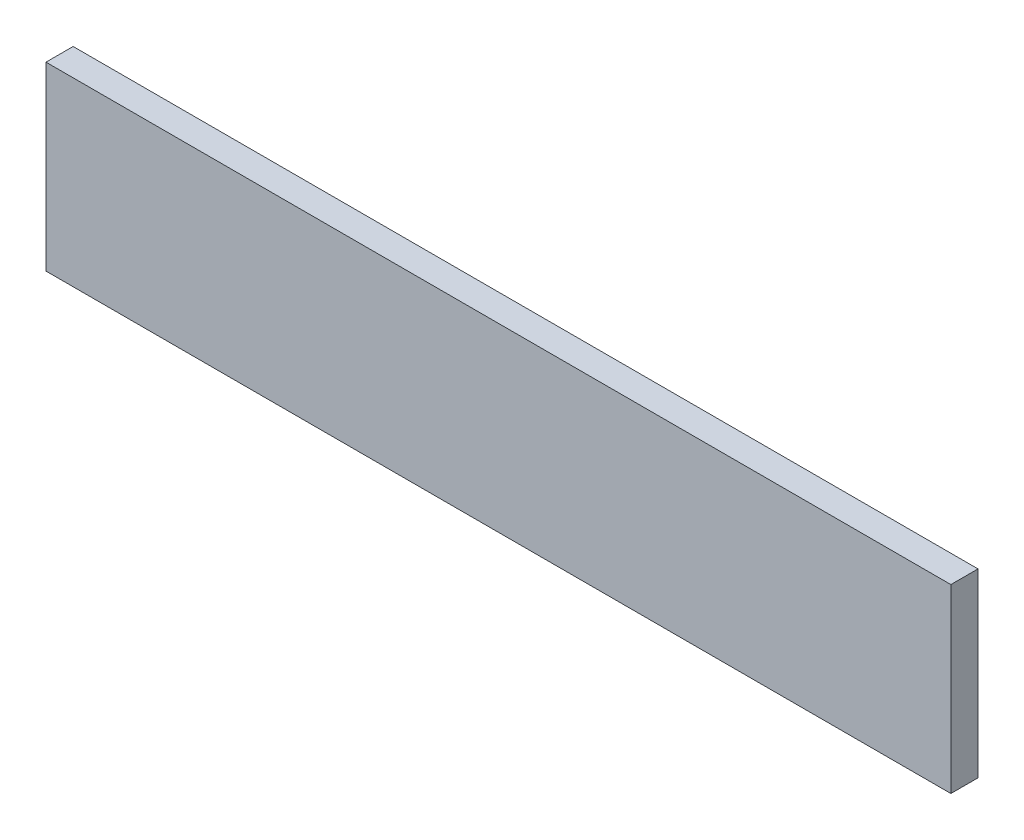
ISO-10303-21;
HEADER;
FILE_DESCRIPTION(('STEP AP214'),'2;1');
FILE_NAME('part.step','',(''),(''),'','','');
FILE_SCHEMA(('AUTOMOTIVE_DESIGN { 1 0 10303 214 1 1 1 1 }'));
ENDSEC;
DATA;
#1=APPLICATION_CONTEXT('core data for automotive mechanical design processes');
#2=APPLICATION_PROTOCOL_DEFINITION('international standard','automotive_design',2000,#1);
#3=PRODUCT_CONTEXT('',#1,'mechanical');
#4=PRODUCT('Part','Part','',(#3));
#5=PRODUCT_RELATED_PRODUCT_CATEGORY('part','',(#4));
#6=PRODUCT_DEFINITION_FORMATION('','',#4);
#7=PRODUCT_DEFINITION_CONTEXT('part definition',#1,'design');
#8=PRODUCT_DEFINITION('design','',#6,#7);
#9=PRODUCT_DEFINITION_SHAPE('','',#8);
#10=(LENGTH_UNIT() NAMED_UNIT(*) SI_UNIT(.MILLI.,.METRE.));
#11=(NAMED_UNIT(*) PLANE_ANGLE_UNIT() SI_UNIT($,.RADIAN.));
#12=(NAMED_UNIT(*) SI_UNIT($,.STERADIAN.) SOLID_ANGLE_UNIT());
#13=UNCERTAINTY_MEASURE_WITH_UNIT(LENGTH_MEASURE(1.E-05),#10,'distance_accuracy_value','');
#14=(GEOMETRIC_REPRESENTATION_CONTEXT(3) GLOBAL_UNCERTAINTY_ASSIGNED_CONTEXT((#13)) GLOBAL_UNIT_ASSIGNED_CONTEXT((#10,
#11,#12)) REPRESENTATION_CONTEXT('',''));
#15=CARTESIAN_POINT('',(0.,0.,0.));
#16=DIRECTION('',(0.,0.,1.));
#17=DIRECTION('',(1.,0.,0.));
#18=AXIS2_PLACEMENT_3D('',#15,#16,#17);
#19=CARTESIAN_POINT('',(-100.,20.,6.));
#20=DIRECTION('',(1.,0.,0.));
#21=DIRECTION('',(0.,0.,-1.));
#22=AXIS2_PLACEMENT_3D('',#19,#20,#21);
#23=PLANE('',#22);
#24=DIRECTION('',(0.,-1.,0.));
#25=VECTOR('',#24,1.);
#26=CARTESIAN_POINT('',(-100.,20.,0.));
#27=LINE('',#26,#25);
#28=CARTESIAN_POINT('',(-100.,20.,0.));
#29=VERTEX_POINT('',#28);
#30=CARTESIAN_POINT('',(-100.,-20.,0.));
#31=VERTEX_POINT('',#30);
#32=EDGE_CURVE('E95',#29,#31,#27,.T.);
#33=ORIENTED_EDGE('',*,*,#32,.T.);
#34=DIRECTION('',(0.,0.,-1.));
#35=VECTOR('',#34,1.);
#36=CARTESIAN_POINT('',(-100.,-20.,6.));
#37=LINE('',#36,#35);
#38=CARTESIAN_POINT('',(-100.,-20.,6.));
#39=VERTEX_POINT('',#38);
#40=EDGE_CURVE('E11',#39,#31,#37,.T.);
#41=ORIENTED_EDGE('',*,*,#40,.F.);
#42=DIRECTION('',(0.,-1.,0.));
#43=VECTOR('',#42,1.);
#44=CARTESIAN_POINT('',(-100.,20.,6.));
#45=LINE('',#44,#43);
#46=CARTESIAN_POINT('',(-100.,20.,6.));
#47=VERTEX_POINT('',#46);
#48=EDGE_CURVE('E83',#47,#39,#45,.T.);
#49=ORIENTED_EDGE('',*,*,#48,.F.);
#50=DIRECTION('',(0.,0.,-1.));
#51=VECTOR('',#50,1.);
#52=CARTESIAN_POINT('',(-100.,20.,6.));
#53=LINE('',#52,#51);
#54=EDGE_CURVE('E91',#47,#29,#53,.T.);
#55=ORIENTED_EDGE('',*,*,#54,.T.);
#56=EDGE_LOOP('',(#33,#41,#49,#55));
#57=FACE_BOUND('',#56,.T.);
#58=ADVANCED_FACE('F32',(#57),#23,.F.);
#59=CARTESIAN_POINT('',(-100.,-20.,6.));
#60=DIRECTION('',(0.,1.,0.));
#61=DIRECTION('',(0.,0.,1.));
#62=AXIS2_PLACEMENT_3D('',#59,#60,#61);
#63=PLANE('',#62);
#64=DIRECTION('',(1.,0.,0.));
#65=VECTOR('',#64,1.);
#66=CARTESIAN_POINT('',(-100.,-20.,0.));
#67=LINE('',#66,#65);
#68=CARTESIAN_POINT('',(100.,-20.,0.));
#69=VERTEX_POINT('',#68);
#70=EDGE_CURVE('E87',#31,#69,#67,.T.);
#71=ORIENTED_EDGE('',*,*,#70,.T.);
#72=DIRECTION('',(0.,0.,-1.));
#73=VECTOR('',#72,1.);
#74=CARTESIAN_POINT('',(100.,-20.,6.));
#75=LINE('',#74,#73);
#76=CARTESIAN_POINT('',(100.,-20.,6.));
#77=VERTEX_POINT('',#76);
#78=EDGE_CURVE('E40',#77,#69,#75,.T.);
#79=ORIENTED_EDGE('',*,*,#78,.F.);
#80=DIRECTION('',(1.,0.,0.));
#81=VECTOR('',#80,1.);
#82=CARTESIAN_POINT('',(-100.,-20.,6.));
#83=LINE('',#82,#81);
#84=EDGE_CURVE('E78',#39,#77,#83,.T.);
#85=ORIENTED_EDGE('',*,*,#84,.F.);
#86=ORIENTED_EDGE('',*,*,#40,.T.);
#87=EDGE_LOOP('',(#71,#79,#85,#86));
#88=FACE_BOUND('',#87,.T.);
#89=ADVANCED_FACE('F86',(#88),#63,.F.);
#90=CARTESIAN_POINT('',(100.,20.,6.));
#91=DIRECTION('',(-1.,0.,0.));
#92=DIRECTION('',(0.,0.,1.));
#93=AXIS2_PLACEMENT_3D('',#90,#91,#92);
#94=PLANE('',#93);
#95=DIRECTION('',(0.,1.,0.));
#96=VECTOR('',#95,1.);
#97=CARTESIAN_POINT('',(100.,20.,0.));
#98=LINE('',#97,#96);
#99=CARTESIAN_POINT('',(100.,20.,0.));
#100=VERTEX_POINT('',#99);
#101=EDGE_CURVE('E65',#69,#100,#98,.T.);
#102=ORIENTED_EDGE('',*,*,#101,.T.);
#103=DIRECTION('',(0.,0.,-1.));
#104=VECTOR('',#103,1.);
#105=CARTESIAN_POINT('',(100.,20.,6.));
#106=LINE('',#105,#104);
#107=CARTESIAN_POINT('',(100.,20.,6.));
#108=VERTEX_POINT('',#107);
#109=EDGE_CURVE('E88',#108,#100,#106,.T.);
#110=ORIENTED_EDGE('',*,*,#109,.F.);
#111=DIRECTION('',(0.,1.,0.));
#112=VECTOR('',#111,1.);
#113=CARTESIAN_POINT('',(100.,20.,6.));
#114=LINE('',#113,#112);
#115=EDGE_CURVE('E81',#77,#108,#114,.T.);
#116=ORIENTED_EDGE('',*,*,#115,.F.);
#117=ORIENTED_EDGE('',*,*,#78,.T.);
#118=EDGE_LOOP('',(#102,#110,#116,#117));
#119=FACE_BOUND('',#118,.T.);
#120=ADVANCED_FACE('F89',(#119),#94,.F.);
#121=CARTESIAN_POINT('',(-100.,20.,6.));
#122=DIRECTION('',(0.,-1.,0.));
#123=DIRECTION('',(0.,0.,-1.));
#124=AXIS2_PLACEMENT_3D('',#121,#122,#123);
#125=PLANE('',#124);
#126=DIRECTION('',(-1.,0.,0.));
#127=VECTOR('',#126,1.);
#128=CARTESIAN_POINT('',(-100.,20.,0.));
#129=LINE('',#128,#127);
#130=EDGE_CURVE('E71',#100,#29,#129,.T.);
#131=ORIENTED_EDGE('',*,*,#130,.T.);
#132=ORIENTED_EDGE('',*,*,#54,.F.);
#133=DIRECTION('',(-1.,0.,0.));
#134=VECTOR('',#133,1.);
#135=CARTESIAN_POINT('',(-100.,20.,6.));
#136=LINE('',#135,#134);
#137=EDGE_CURVE('E48',#108,#47,#136,.T.);
#138=ORIENTED_EDGE('',*,*,#137,.F.);
#139=ORIENTED_EDGE('',*,*,#109,.T.);
#140=EDGE_LOOP('',(#131,#132,#138,#139));
#141=FACE_BOUND('',#140,.T.);
#142=ADVANCED_FACE('F102',(#141),#125,.F.);
#143=CARTESIAN_POINT('',(0.,0.,6.));
#144=DIRECTION('',(0.,0.,1.));
#145=DIRECTION('',(1.,0.,0.));
#146=AXIS2_PLACEMENT_3D('',#143,#144,#145);
#147=PLANE('',#146);
#148=ORIENTED_EDGE('',*,*,#48,.T.);
#149=ORIENTED_EDGE('',*,*,#84,.T.);
#150=ORIENTED_EDGE('',*,*,#115,.T.);
#151=ORIENTED_EDGE('',*,*,#137,.T.);
#152=EDGE_LOOP('',(#148,#149,#150,#151));
#153=FACE_BOUND('',#152,.T.);
#154=ADVANCED_FACE('F79',(#153),#147,.T.);
#155=CARTESIAN_POINT('',(0.,0.,0.));
#156=DIRECTION('',(0.,0.,1.));
#157=DIRECTION('',(1.,0.,0.));
#158=AXIS2_PLACEMENT_3D('',#155,#156,#157);
#159=PLANE('',#158);
#160=ORIENTED_EDGE('',*,*,#32,.F.);
#161=ORIENTED_EDGE('',*,*,#130,.F.);
#162=ORIENTED_EDGE('',*,*,#101,.F.);
#163=ORIENTED_EDGE('',*,*,#70,.F.);
#164=EDGE_LOOP('',(#160,#161,#162,#163));
#165=FACE_BOUND('',#164,.T.);
#166=ADVANCED_FACE('F105',(#165),#159,.F.);
#167=CLOSED_SHELL('',(#58,#89,#120,#142,#154,#166));
#168=MANIFOLD_SOLID_BREP('B2',#167);
#169=ADVANCED_BREP_SHAPE_REPRESENTATION('',(#18,#168),#14);
#170=SHAPE_DEFINITION_REPRESENTATION(#9,#169);
ENDSEC;
END-ISO-10303-21;
